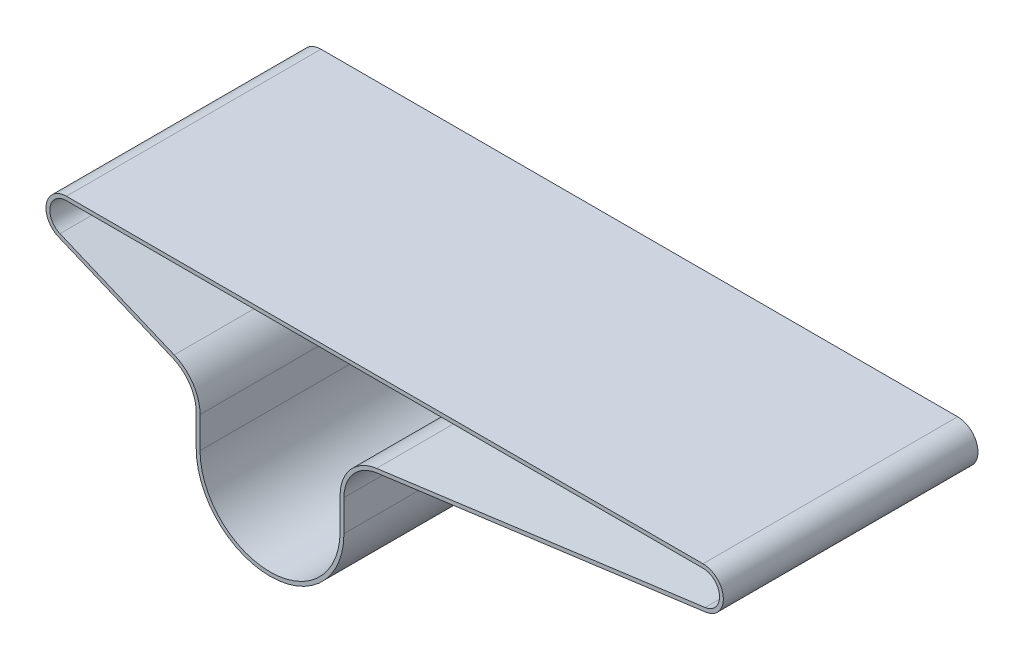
ISO-10303-21;
HEADER;
FILE_DESCRIPTION(('STEP AP214'),'2;1');
FILE_NAME('part.step','',(''),(''),'','','');
FILE_SCHEMA(('AUTOMOTIVE_DESIGN { 1 0 10303 214 1 1 1 1 }'));
ENDSEC;
DATA;
#1=APPLICATION_CONTEXT('core data for automotive mechanical design processes');
#2=APPLICATION_PROTOCOL_DEFINITION('international standard','automotive_design',2000,#1);
#3=PRODUCT_CONTEXT('',#1,'mechanical');
#4=PRODUCT('Part','Part','',(#3));
#5=PRODUCT_RELATED_PRODUCT_CATEGORY('part','',(#4));
#6=PRODUCT_DEFINITION_FORMATION('','',#4);
#7=PRODUCT_DEFINITION_CONTEXT('part definition',#1,'design');
#8=PRODUCT_DEFINITION('design','',#6,#7);
#9=PRODUCT_DEFINITION_SHAPE('','',#8);
#10=(LENGTH_UNIT() NAMED_UNIT(*) SI_UNIT(.MILLI.,.METRE.));
#11=(NAMED_UNIT(*) PLANE_ANGLE_UNIT() SI_UNIT($,.RADIAN.));
#12=(NAMED_UNIT(*) SI_UNIT($,.STERADIAN.) SOLID_ANGLE_UNIT());
#13=UNCERTAINTY_MEASURE_WITH_UNIT(LENGTH_MEASURE(1.E-05),#10,'distance_accuracy_value','');
#14=(GEOMETRIC_REPRESENTATION_CONTEXT(3) GLOBAL_UNCERTAINTY_ASSIGNED_CONTEXT((#13)) GLOBAL_UNIT_ASSIGNED_CONTEXT((#10,
#11,#12)) REPRESENTATION_CONTEXT('',''));
#15=CARTESIAN_POINT('',(0.,0.,0.));
#16=DIRECTION('',(0.,0.,1.));
#17=DIRECTION('',(1.,0.,0.));
#18=AXIS2_PLACEMENT_3D('',#15,#16,#17);
#19=CARTESIAN_POINT('',(0.,0.,50.));
#20=DIRECTION('',(0.,0.,1.));
#21=DIRECTION('',(1.,0.,0.));
#22=AXIS2_PLACEMENT_3D('',#19,#20,#21);
#23=PLANE('',#22);
#24=CARTESIAN_POINT('',(0.,0.,50.));
#25=DIRECTION('',(0.,0.,1.));
#26=DIRECTION('',(1.,0.,0.));
#27=AXIS2_PLACEMENT_3D('',#24,#25,#26);
#28=CIRCLE('',#27,8.);
#29=CARTESIAN_POINT('',(0.,8.,50.));
#30=VERTEX_POINT('',#29);
#31=CARTESIAN_POINT('',(-3.08859936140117,-7.37973942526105,50.));
#32=VERTEX_POINT('',#31);
#33=EDGE_CURVE('E2895',#30,#32,#28,.T.);
#34=ORIENTED_EDGE('',*,*,#33,.T.);
#35=DIRECTION('',(0.922467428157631,-0.386074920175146,0.));
#36=VECTOR('',#35,1.);
#37=CARTESIAN_POINT('',(-3.08859936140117,-7.37973942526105,50.));
#38=LINE('',#37,#36);
#39=CARTESIAN_POINT('',(41.7911238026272,-26.1629885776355,50.));
#40=VERTEX_POINT('',#39);
#41=EDGE_CURVE('E2898',#32,#40,#38,.T.);
#42=ORIENTED_EDGE('',*,*,#41,.T.);
#43=CARTESIAN_POINT('',(36.,-40.,50.));
#44=DIRECTION('',(0.,0.,1.));
#45=DIRECTION('',(1.,0.,0.));
#46=AXIS2_PLACEMENT_3D('',#43,#44,#45);
#47=CIRCLE('',#46,15.);
#48=CARTESIAN_POINT('',(51.,-40.,50.));
#49=VERTEX_POINT('',#48);
#50=EDGE_CURVE('E2900',#40,#49,#47,.F.);
#51=ORIENTED_EDGE('',*,*,#50,.T.);
#52=DIRECTION('',(0.,-1.,0.));
#53=VECTOR('',#52,1.);
#54=CARTESIAN_POINT('',(51.,-40.,50.));
#55=LINE('',#54,#53);
#56=CARTESIAN_POINT('',(51.,-52.274500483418,50.));
#57=VERTEX_POINT('',#56);
#58=EDGE_CURVE('E2902',#49,#57,#55,.T.);
#59=ORIENTED_EDGE('',*,*,#58,.T.);
#60=CARTESIAN_POINT('',(80.,-52.274500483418,50.));
#61=DIRECTION('',(0.,0.,1.));
#62=DIRECTION('',(1.,0.,0.));
#63=AXIS2_PLACEMENT_3D('',#60,#61,#62);
#64=CIRCLE('',#63,29.);
#65=CARTESIAN_POINT('',(109.,-52.274500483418,50.));
#66=VERTEX_POINT('',#65);
#67=EDGE_CURVE('E2904',#57,#66,#64,.T.);
#68=ORIENTED_EDGE('',*,*,#67,.T.);
#69=DIRECTION('',(0.,1.,0.));
#70=VECTOR('',#69,1.);
#71=CARTESIAN_POINT('',(109.,-52.274500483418,50.));
#72=LINE('',#71,#70);
#73=CARTESIAN_POINT('',(109.,-40.,50.));
#74=VERTEX_POINT('',#73);
#75=EDGE_CURVE('E2906',#66,#74,#72,.T.);
#76=ORIENTED_EDGE('',*,*,#75,.T.);
#77=CARTESIAN_POINT('',(124.,-40.,50.));
#78=DIRECTION('',(0.,0.,1.));
#79=DIRECTION('',(1.,0.,0.));
#80=AXIS2_PLACEMENT_3D('',#77,#78,#79);
#81=CIRCLE('',#80,15.);
#82=CARTESIAN_POINT('',(122.017945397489,-25.131528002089,50.));
#83=VERTEX_POINT('',#82);
#84=EDGE_CURVE('E2908',#74,#83,#81,.F.);
#85=ORIENTED_EDGE('',*,*,#84,.T.);
#86=DIRECTION('',(0.9912314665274,0.132136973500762,0.));
#87=VECTOR('',#86,1.);
#88=CARTESIAN_POINT('',(122.017945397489,-25.131528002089,50.));
#89=LINE('',#88,#87);
#90=CARTESIAN_POINT('',(251.057095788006,-7.92985173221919,50.));
#91=VERTEX_POINT('',#90);
#92=EDGE_CURVE('E2910',#83,#91,#89,.T.);
#93=ORIENTED_EDGE('',*,*,#92,.T.);
#94=CARTESIAN_POINT('',(250.,0.,50.));
#95=DIRECTION('',(0.,0.,1.));
#96=DIRECTION('',(1.,0.,0.));
#97=AXIS2_PLACEMENT_3D('',#94,#95,#96);
#98=CIRCLE('',#97,8.00000000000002);
#99=CARTESIAN_POINT('',(250.,8.00000000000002,50.));
#100=VERTEX_POINT('',#99);
#101=EDGE_CURVE('E2912',#91,#100,#98,.T.);
#102=ORIENTED_EDGE('',*,*,#101,.T.);
#103=DIRECTION('',(-1.,0.,0.));
#104=VECTOR('',#103,1.);
#105=CARTESIAN_POINT('',(250.,8.00000000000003,50.));
#106=LINE('',#105,#104);
#107=EDGE_CURVE('E2914',#100,#30,#106,.T.);
#108=ORIENTED_EDGE('',*,*,#107,.T.);
#109=EDGE_LOOP('',(#34,#42,#51,#59,#68,#76,#85,#93,#102,#108));
#110=FACE_BOUND('',#109,.T.);
#111=DIRECTION('',(0.922467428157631,-0.386074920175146,0.));
#112=VECTOR('',#111,1.);
#113=CARTESIAN_POINT('',(-2.50948698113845,-5.9960382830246,50.));
#114=LINE('',#113,#112);
#115=CARTESIAN_POINT('',(-2.50948698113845,-5.9960382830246,50.));
#116=VERTEX_POINT('',#115);
#117=CARTESIAN_POINT('',(42.3702361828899,-24.7792874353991,50.));
#118=VERTEX_POINT('',#117);
#119=EDGE_CURVE('E2841',#116,#118,#114,.T.);
#120=ORIENTED_EDGE('',*,*,#119,.F.);
#121=CARTESIAN_POINT('',(0.,0.,50.));
#122=DIRECTION('',(0.,0.,1.));
#123=DIRECTION('',(1.,0.,0.));
#124=AXIS2_PLACEMENT_3D('',#121,#122,#123);
#125=CIRCLE('',#124,6.5);
#126=CARTESIAN_POINT('',(0.,6.5,50.));
#127=VERTEX_POINT('',#126);
#128=EDGE_CURVE('E2812',#127,#116,#125,.T.);
#129=ORIENTED_EDGE('',*,*,#128,.F.);
#130=DIRECTION('',(-1.,0.,0.));
#131=VECTOR('',#130,1.);
#132=CARTESIAN_POINT('',(250.,6.50000000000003,50.));
#133=LINE('',#132,#131);
#134=CARTESIAN_POINT('',(250.,6.50000000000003,50.));
#135=VERTEX_POINT('',#134);
#136=EDGE_CURVE('E2857',#135,#127,#133,.T.);
#137=ORIENTED_EDGE('',*,*,#136,.F.);
#138=CARTESIAN_POINT('',(250.,0.,50.));
#139=DIRECTION('',(0.,0.,1.));
#140=DIRECTION('',(1.,0.,0.));
#141=AXIS2_PLACEMENT_3D('',#138,#139,#140);
#142=CIRCLE('',#141,6.50000000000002);
#143=CARTESIAN_POINT('',(250.858890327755,-6.44300453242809,50.));
#144=VERTEX_POINT('',#143);
#145=EDGE_CURVE('E2855',#144,#135,#142,.T.);
#146=ORIENTED_EDGE('',*,*,#145,.F.);
#147=DIRECTION('',(0.9912314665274,0.132136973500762,0.));
#148=VECTOR('',#147,1.);
#149=CARTESIAN_POINT('',(121.819739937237,-23.6446808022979,50.));
#150=LINE('',#149,#148);
#151=CARTESIAN_POINT('',(121.819739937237,-23.6446808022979,50.));
#152=VERTEX_POINT('',#151);
#153=EDGE_CURVE('E2853',#152,#144,#150,.T.);
#154=ORIENTED_EDGE('',*,*,#153,.F.);
#155=CARTESIAN_POINT('',(124.,-40.,50.));
#156=DIRECTION('',(0.,0.,1.));
#157=DIRECTION('',(1.,0.,0.));
#158=AXIS2_PLACEMENT_3D('',#155,#156,#157);
#159=CIRCLE('',#158,16.5);
#160=CARTESIAN_POINT('',(107.5,-40.,50.));
#161=VERTEX_POINT('',#160);
#162=EDGE_CURVE('E2851',#161,#152,#159,.F.);
#163=ORIENTED_EDGE('',*,*,#162,.F.);
#164=DIRECTION('',(0.,1.,0.));
#165=VECTOR('',#164,1.);
#166=CARTESIAN_POINT('',(107.5,-52.274500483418,50.));
#167=LINE('',#166,#165);
#168=CARTESIAN_POINT('',(107.5,-52.274500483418,50.));
#169=VERTEX_POINT('',#168);
#170=EDGE_CURVE('E2849',#169,#161,#167,.T.);
#171=ORIENTED_EDGE('',*,*,#170,.F.);
#172=CARTESIAN_POINT('',(80.,-52.274500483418,50.));
#173=DIRECTION('',(0.,0.,1.));
#174=DIRECTION('',(1.,0.,0.));
#175=AXIS2_PLACEMENT_3D('',#172,#173,#174);
#176=CIRCLE('',#175,27.5);
#177=CARTESIAN_POINT('',(52.5,-52.274500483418,50.));
#178=VERTEX_POINT('',#177);
#179=EDGE_CURVE('E2847',#178,#169,#176,.T.);
#180=ORIENTED_EDGE('',*,*,#179,.F.);
#181=DIRECTION('',(0.,-1.,0.));
#182=VECTOR('',#181,1.);
#183=CARTESIAN_POINT('',(52.5,-40.,50.));
#184=LINE('',#183,#182);
#185=CARTESIAN_POINT('',(52.5,-40.,50.));
#186=VERTEX_POINT('',#185);
#187=EDGE_CURVE('E2845',#186,#178,#184,.T.);
#188=ORIENTED_EDGE('',*,*,#187,.F.);
#189=CARTESIAN_POINT('',(36.,-40.,50.));
#190=DIRECTION('',(0.,0.,1.));
#191=DIRECTION('',(1.,0.,0.));
#192=AXIS2_PLACEMENT_3D('',#189,#190,#191);
#193=CIRCLE('',#192,16.5);
#194=EDGE_CURVE('E2843',#118,#186,#193,.F.);
#195=ORIENTED_EDGE('',*,*,#194,.F.);
#196=EDGE_LOOP('',(#120,#129,#137,#146,#154,#163,#171,#180,#188,#195));
#197=FACE_BOUND('',#196,.T.);
#198=ADVANCED_FACE('F2660',(#110,#197),#23,.T.);
#199=CARTESIAN_POINT('',(0.,0.,-50.));
#200=DIRECTION('',(0.,0.,1.));
#201=DIRECTION('',(1.,0.,0.));
#202=AXIS2_PLACEMENT_3D('',#199,#200,#201);
#203=PLANE('',#202);
#204=CARTESIAN_POINT('',(0.,0.,-50.));
#205=DIRECTION('',(0.,0.,1.));
#206=DIRECTION('',(1.,0.,0.));
#207=AXIS2_PLACEMENT_3D('',#204,#205,#206);
#208=CIRCLE('',#207,8.);
#209=CARTESIAN_POINT('',(0.,8.,-50.));
#210=VERTEX_POINT('',#209);
#211=CARTESIAN_POINT('',(-3.08859936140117,-7.37973942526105,-50.));
#212=VERTEX_POINT('',#211);
#213=EDGE_CURVE('E2813',#210,#212,#208,.T.);
#214=ORIENTED_EDGE('',*,*,#213,.F.);
#215=DIRECTION('',(-1.,0.,0.));
#216=VECTOR('',#215,1.);
#217=CARTESIAN_POINT('',(250.,8.00000000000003,-50.));
#218=LINE('',#217,#216);
#219=CARTESIAN_POINT('',(250.,8.00000000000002,-50.));
#220=VERTEX_POINT('',#219);
#221=EDGE_CURVE('E2893',#220,#210,#218,.T.);
#222=ORIENTED_EDGE('',*,*,#221,.F.);
#223=CARTESIAN_POINT('',(250.,0.,-50.));
#224=DIRECTION('',(0.,0.,1.));
#225=DIRECTION('',(1.,0.,0.));
#226=AXIS2_PLACEMENT_3D('',#223,#224,#225);
#227=CIRCLE('',#226,8.00000000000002);
#228=CARTESIAN_POINT('',(251.057095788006,-7.92985173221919,-50.));
#229=VERTEX_POINT('',#228);
#230=EDGE_CURVE('E2891',#229,#220,#227,.T.);
#231=ORIENTED_EDGE('',*,*,#230,.F.);
#232=DIRECTION('',(0.9912314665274,0.132136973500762,0.));
#233=VECTOR('',#232,1.);
#234=CARTESIAN_POINT('',(122.017945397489,-25.131528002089,-50.));
#235=LINE('',#234,#233);
#236=CARTESIAN_POINT('',(122.017945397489,-25.131528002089,-50.));
#237=VERTEX_POINT('',#236);
#238=EDGE_CURVE('E2889',#237,#229,#235,.T.);
#239=ORIENTED_EDGE('',*,*,#238,.F.);
#240=CARTESIAN_POINT('',(124.,-40.,-50.));
#241=DIRECTION('',(0.,0.,1.));
#242=DIRECTION('',(1.,0.,0.));
#243=AXIS2_PLACEMENT_3D('',#240,#241,#242);
#244=CIRCLE('',#243,15.);
#245=CARTESIAN_POINT('',(109.,-40.,-50.));
#246=VERTEX_POINT('',#245);
#247=EDGE_CURVE('E2887',#246,#237,#244,.F.);
#248=ORIENTED_EDGE('',*,*,#247,.F.);
#249=DIRECTION('',(0.,1.,0.));
#250=VECTOR('',#249,1.);
#251=CARTESIAN_POINT('',(109.,-52.274500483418,-50.));
#252=LINE('',#251,#250);
#253=CARTESIAN_POINT('',(109.,-52.274500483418,-50.));
#254=VERTEX_POINT('',#253);
#255=EDGE_CURVE('E2885',#254,#246,#252,.T.);
#256=ORIENTED_EDGE('',*,*,#255,.F.);
#257=CARTESIAN_POINT('',(80.,-52.274500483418,-50.));
#258=DIRECTION('',(0.,0.,1.));
#259=DIRECTION('',(1.,0.,0.));
#260=AXIS2_PLACEMENT_3D('',#257,#258,#259);
#261=CIRCLE('',#260,29.);
#262=CARTESIAN_POINT('',(51.,-52.274500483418,-50.));
#263=VERTEX_POINT('',#262);
#264=EDGE_CURVE('E2883',#263,#254,#261,.T.);
#265=ORIENTED_EDGE('',*,*,#264,.F.);
#266=DIRECTION('',(0.,-1.,0.));
#267=VECTOR('',#266,1.);
#268=CARTESIAN_POINT('',(51.,-40.,-50.));
#269=LINE('',#268,#267);
#270=CARTESIAN_POINT('',(51.,-40.,-50.));
#271=VERTEX_POINT('',#270);
#272=EDGE_CURVE('E2881',#271,#263,#269,.T.);
#273=ORIENTED_EDGE('',*,*,#272,.F.);
#274=CARTESIAN_POINT('',(36.,-40.,-50.));
#275=DIRECTION('',(0.,0.,1.));
#276=DIRECTION('',(1.,0.,0.));
#277=AXIS2_PLACEMENT_3D('',#274,#275,#276);
#278=CIRCLE('',#277,15.);
#279=CARTESIAN_POINT('',(41.7911238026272,-26.1629885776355,-50.));
#280=VERTEX_POINT('',#279);
#281=EDGE_CURVE('E2879',#280,#271,#278,.F.);
#282=ORIENTED_EDGE('',*,*,#281,.F.);
#283=DIRECTION('',(0.922467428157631,-0.386074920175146,0.));
#284=VECTOR('',#283,1.);
#285=CARTESIAN_POINT('',(-3.08859936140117,-7.37973942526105,-50.));
#286=LINE('',#285,#284);
#287=EDGE_CURVE('E2877',#212,#280,#286,.T.);
#288=ORIENTED_EDGE('',*,*,#287,.F.);
#289=EDGE_LOOP('',(#214,#222,#231,#239,#248,#256,#265,#273,#282,#288));
#290=FACE_BOUND('',#289,.T.);
#291=CARTESIAN_POINT('',(0.,0.,-50.));
#292=DIRECTION('',(0.,0.,1.));
#293=DIRECTION('',(1.,0.,0.));
#294=AXIS2_PLACEMENT_3D('',#291,#292,#293);
#295=CIRCLE('',#294,6.5);
#296=CARTESIAN_POINT('',(0.,6.5,-50.));
#297=VERTEX_POINT('',#296);
#298=CARTESIAN_POINT('',(-2.50948698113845,-5.9960382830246,-50.));
#299=VERTEX_POINT('',#298);
#300=EDGE_CURVE('E2683',#297,#299,#295,.T.);
#301=ORIENTED_EDGE('',*,*,#300,.T.);
#302=DIRECTION('',(0.922467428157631,-0.386074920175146,0.));
#303=VECTOR('',#302,1.);
#304=CARTESIAN_POINT('',(-2.50948698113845,-5.9960382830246,-50.));
#305=LINE('',#304,#303);
#306=CARTESIAN_POINT('',(42.3702361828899,-24.7792874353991,-50.));
#307=VERTEX_POINT('',#306);
#308=EDGE_CURVE('E2799',#299,#307,#305,.T.);
#309=ORIENTED_EDGE('',*,*,#308,.T.);
#310=CARTESIAN_POINT('',(36.,-40.,-50.));
#311=DIRECTION('',(0.,0.,1.));
#312=DIRECTION('',(1.,0.,0.));
#313=AXIS2_PLACEMENT_3D('',#310,#311,#312);
#314=CIRCLE('',#313,16.5);
#315=CARTESIAN_POINT('',(52.5,-40.,-50.));
#316=VERTEX_POINT('',#315);
#317=EDGE_CURVE('E2808',#307,#316,#314,.F.);
#318=ORIENTED_EDGE('',*,*,#317,.T.);
#319=DIRECTION('',(0.,-1.,0.));
#320=VECTOR('',#319,1.);
#321=CARTESIAN_POINT('',(52.5,-40.,-50.));
#322=LINE('',#321,#320);
#323=CARTESIAN_POINT('',(52.5,-52.274500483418,-50.));
#324=VERTEX_POINT('',#323);
#325=EDGE_CURVE('E2822',#316,#324,#322,.T.);
#326=ORIENTED_EDGE('',*,*,#325,.T.);
#327=CARTESIAN_POINT('',(80.,-52.274500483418,-50.));
#328=DIRECTION('',(0.,0.,1.));
#329=DIRECTION('',(1.,0.,0.));
#330=AXIS2_PLACEMENT_3D('',#327,#328,#329);
#331=CIRCLE('',#330,27.5);
#332=CARTESIAN_POINT('',(107.5,-52.274500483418,-50.));
#333=VERTEX_POINT('',#332);
#334=EDGE_CURVE('E2825',#324,#333,#331,.T.);
#335=ORIENTED_EDGE('',*,*,#334,.T.);
#336=DIRECTION('',(0.,1.,0.));
#337=VECTOR('',#336,1.);
#338=CARTESIAN_POINT('',(107.5,-52.274500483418,-50.));
#339=LINE('',#338,#337);
#340=CARTESIAN_POINT('',(107.5,-40.,-50.));
#341=VERTEX_POINT('',#340);
#342=EDGE_CURVE('E2828',#333,#341,#339,.T.);
#343=ORIENTED_EDGE('',*,*,#342,.T.);
#344=CARTESIAN_POINT('',(124.,-40.,-50.));
#345=DIRECTION('',(0.,0.,1.));
#346=DIRECTION('',(1.,0.,0.));
#347=AXIS2_PLACEMENT_3D('',#344,#345,#346);
#348=CIRCLE('',#347,16.5);
#349=CARTESIAN_POINT('',(121.819739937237,-23.6446808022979,-50.));
#350=VERTEX_POINT('',#349);
#351=EDGE_CURVE('E2831',#341,#350,#348,.F.);
#352=ORIENTED_EDGE('',*,*,#351,.T.);
#353=DIRECTION('',(0.9912314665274,0.132136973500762,0.));
#354=VECTOR('',#353,1.);
#355=CARTESIAN_POINT('',(121.819739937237,-23.6446808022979,-50.));
#356=LINE('',#355,#354);
#357=CARTESIAN_POINT('',(250.858890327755,-6.44300453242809,-50.));
#358=VERTEX_POINT('',#357);
#359=EDGE_CURVE('E2834',#350,#358,#356,.T.);
#360=ORIENTED_EDGE('',*,*,#359,.T.);
#361=CARTESIAN_POINT('',(250.,0.,-50.));
#362=DIRECTION('',(0.,0.,1.));
#363=DIRECTION('',(1.,0.,0.));
#364=AXIS2_PLACEMENT_3D('',#361,#362,#363);
#365=CIRCLE('',#364,6.50000000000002);
#366=CARTESIAN_POINT('',(250.,6.50000000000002,-50.));
#367=VERTEX_POINT('',#366);
#368=EDGE_CURVE('E2837',#358,#367,#365,.T.);
#369=ORIENTED_EDGE('',*,*,#368,.T.);
#370=DIRECTION('',(-1.,0.,0.));
#371=VECTOR('',#370,1.);
#372=CARTESIAN_POINT('',(250.,6.50000000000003,-50.));
#373=LINE('',#372,#371);
#374=EDGE_CURVE('E2818',#367,#297,#373,.T.);
#375=ORIENTED_EDGE('',*,*,#374,.T.);
#376=EDGE_LOOP('',(#301,#309,#318,#326,#335,#343,#352,#360,#369,#375));
#377=FACE_BOUND('',#376,.T.);
#378=ADVANCED_FACE('F2816',(#290,#377),#203,.F.);
#379=CARTESIAN_POINT('',(0.,0.,50.));
#380=DIRECTION('',(0.,0.,-1.));
#381=DIRECTION('',(-1.,0.,0.));
#382=AXIS2_PLACEMENT_3D('',#379,#380,#381);
#383=CYLINDRICAL_SURFACE('',#382,8.);
#384=ORIENTED_EDGE('',*,*,#213,.T.);
#385=DIRECTION('',(0.,0.,-1.));
#386=VECTOR('',#385,1.);
#387=CARTESIAN_POINT('',(-3.08859936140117,-7.37973942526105,50.));
#388=LINE('',#387,#386);
#389=EDGE_CURVE('E12',#32,#212,#388,.T.);
#390=ORIENTED_EDGE('',*,*,#389,.F.);
#391=ORIENTED_EDGE('',*,*,#33,.F.);
#392=DIRECTION('',(0.,0.,-1.));
#393=VECTOR('',#392,1.);
#394=CARTESIAN_POINT('',(0.,8.,50.));
#395=LINE('',#394,#393);
#396=EDGE_CURVE('E2916',#30,#210,#395,.T.);
#397=ORIENTED_EDGE('',*,*,#396,.T.);
#398=EDGE_LOOP('',(#384,#390,#391,#397));
#399=FACE_BOUND('',#398,.T.);
#400=ADVANCED_FACE('F2662',(#399),#383,.T.);
#401=CARTESIAN_POINT('',(-3.08859936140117,-7.37973942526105,50.));
#402=DIRECTION('',(0.386074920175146,0.922467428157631,0.));
#403=DIRECTION('',(-0.922467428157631,0.386074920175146,0.));
#404=AXIS2_PLACEMENT_3D('',#401,#402,#403);
#405=PLANE('',#404);
#406=ORIENTED_EDGE('',*,*,#287,.T.);
#407=DIRECTION('',(0.,0.,-1.));
#408=VECTOR('',#407,1.);
#409=CARTESIAN_POINT('',(41.7911238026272,-26.1629885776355,50.));
#410=LINE('',#409,#408);
#411=EDGE_CURVE('E2668',#40,#280,#410,.T.);
#412=ORIENTED_EDGE('',*,*,#411,.F.);
#413=ORIENTED_EDGE('',*,*,#41,.F.);
#414=ORIENTED_EDGE('',*,*,#389,.T.);
#415=EDGE_LOOP('',(#406,#412,#413,#414));
#416=FACE_BOUND('',#415,.T.);
#417=ADVANCED_FACE('F2966',(#416),#405,.F.);
#418=CARTESIAN_POINT('',(36.,-40.,50.));
#419=DIRECTION('',(0.,0.,-1.));
#420=DIRECTION('',(-1.,0.,0.));
#421=AXIS2_PLACEMENT_3D('',#418,#419,#420);
#422=CYLINDRICAL_SURFACE('',#421,15.);
#423=ORIENTED_EDGE('',*,*,#281,.T.);
#424=DIRECTION('',(0.,0.,-1.));
#425=VECTOR('',#424,1.);
#426=CARTESIAN_POINT('',(51.,-40.,50.));
#427=LINE('',#426,#425);
#428=EDGE_CURVE('E2937',#49,#271,#427,.T.);
#429=ORIENTED_EDGE('',*,*,#428,.F.);
#430=ORIENTED_EDGE('',*,*,#50,.F.);
#431=ORIENTED_EDGE('',*,*,#411,.T.);
#432=EDGE_LOOP('',(#423,#429,#430,#431));
#433=FACE_BOUND('',#432,.T.);
#434=ADVANCED_FACE('F2944',(#433),#422,.F.);
#435=CARTESIAN_POINT('',(51.,-40.,50.));
#436=DIRECTION('',(1.,0.,0.));
#437=DIRECTION('',(0.,0.,-1.));
#438=AXIS2_PLACEMENT_3D('',#435,#436,#437);
#439=PLANE('',#438);
#440=ORIENTED_EDGE('',*,*,#272,.T.);
#441=DIRECTION('',(0.,0.,-1.));
#442=VECTOR('',#441,1.);
#443=CARTESIAN_POINT('',(51.,-52.274500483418,50.));
#444=LINE('',#443,#442);
#445=EDGE_CURVE('E2934',#57,#263,#444,.T.);
#446=ORIENTED_EDGE('',*,*,#445,.F.);
#447=ORIENTED_EDGE('',*,*,#58,.F.);
#448=ORIENTED_EDGE('',*,*,#428,.T.);
#449=EDGE_LOOP('',(#440,#446,#447,#448));
#450=FACE_BOUND('',#449,.T.);
#451=ADVANCED_FACE('F2954',(#450),#439,.F.);
#452=CARTESIAN_POINT('',(80.,-52.274500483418,50.));
#453=DIRECTION('',(0.,0.,-1.));
#454=DIRECTION('',(-1.,0.,0.));
#455=AXIS2_PLACEMENT_3D('',#452,#453,#454);
#456=CYLINDRICAL_SURFACE('',#455,29.);
#457=ORIENTED_EDGE('',*,*,#264,.T.);
#458=DIRECTION('',(0.,0.,-1.));
#459=VECTOR('',#458,1.);
#460=CARTESIAN_POINT('',(109.,-52.274500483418,50.));
#461=LINE('',#460,#459);
#462=EDGE_CURVE('E2931',#66,#254,#461,.T.);
#463=ORIENTED_EDGE('',*,*,#462,.F.);
#464=ORIENTED_EDGE('',*,*,#67,.F.);
#465=ORIENTED_EDGE('',*,*,#445,.T.);
#466=EDGE_LOOP('',(#457,#463,#464,#465));
#467=FACE_BOUND('',#466,.T.);
#468=ADVANCED_FACE('F2958',(#467),#456,.T.);
#469=CARTESIAN_POINT('',(109.,-52.274500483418,50.));
#470=DIRECTION('',(-1.,0.,0.));
#471=DIRECTION('',(0.,0.,1.));
#472=AXIS2_PLACEMENT_3D('',#469,#470,#471);
#473=PLANE('',#472);
#474=ORIENTED_EDGE('',*,*,#255,.T.);
#475=DIRECTION('',(0.,0.,-1.));
#476=VECTOR('',#475,1.);
#477=CARTESIAN_POINT('',(109.,-40.,50.));
#478=LINE('',#477,#476);
#479=EDGE_CURVE('E2928',#74,#246,#478,.T.);
#480=ORIENTED_EDGE('',*,*,#479,.F.);
#481=ORIENTED_EDGE('',*,*,#75,.F.);
#482=ORIENTED_EDGE('',*,*,#462,.T.);
#483=EDGE_LOOP('',(#474,#480,#481,#482));
#484=FACE_BOUND('',#483,.T.);
#485=ADVANCED_FACE('F2989',(#484),#473,.F.);
#486=CARTESIAN_POINT('',(124.,-40.,50.));
#487=DIRECTION('',(0.,0.,-1.));
#488=DIRECTION('',(-1.,0.,0.));
#489=AXIS2_PLACEMENT_3D('',#486,#487,#488);
#490=CYLINDRICAL_SURFACE('',#489,15.);
#491=ORIENTED_EDGE('',*,*,#247,.T.);
#492=DIRECTION('',(0.,0.,-1.));
#493=VECTOR('',#492,1.);
#494=CARTESIAN_POINT('',(122.017945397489,-25.131528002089,50.));
#495=LINE('',#494,#493);
#496=EDGE_CURVE('E2925',#83,#237,#495,.T.);
#497=ORIENTED_EDGE('',*,*,#496,.F.);
#498=ORIENTED_EDGE('',*,*,#84,.F.);
#499=ORIENTED_EDGE('',*,*,#479,.T.);
#500=EDGE_LOOP('',(#491,#497,#498,#499));
#501=FACE_BOUND('',#500,.T.);
#502=ADVANCED_FACE('F2986',(#501),#490,.F.);
#503=CARTESIAN_POINT('',(122.017945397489,-25.131528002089,50.));
#504=DIRECTION('',(-0.132136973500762,0.991231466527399,0.));
#505=DIRECTION('',(-0.9912314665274,-0.132136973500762,0.));
#506=AXIS2_PLACEMENT_3D('',#503,#504,#505);
#507=PLANE('',#506);
#508=ORIENTED_EDGE('',*,*,#238,.T.);
#509=DIRECTION('',(0.,0.,-1.));
#510=VECTOR('',#509,1.);
#511=CARTESIAN_POINT('',(251.057095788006,-7.92985173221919,50.));
#512=LINE('',#511,#510);
#513=EDGE_CURVE('E2922',#91,#229,#512,.T.);
#514=ORIENTED_EDGE('',*,*,#513,.F.);
#515=ORIENTED_EDGE('',*,*,#92,.F.);
#516=ORIENTED_EDGE('',*,*,#496,.T.);
#517=EDGE_LOOP('',(#508,#514,#515,#516));
#518=FACE_BOUND('',#517,.T.);
#519=ADVANCED_FACE('F2982',(#518),#507,.F.);
#520=CARTESIAN_POINT('',(250.,0.,50.));
#521=DIRECTION('',(0.,0.,-1.));
#522=DIRECTION('',(-1.,0.,0.));
#523=AXIS2_PLACEMENT_3D('',#520,#521,#522);
#524=CYLINDRICAL_SURFACE('',#523,8.00000000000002);
#525=ORIENTED_EDGE('',*,*,#230,.T.);
#526=DIRECTION('',(0.,0.,-1.));
#527=VECTOR('',#526,1.);
#528=CARTESIAN_POINT('',(250.,8.00000000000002,50.));
#529=LINE('',#528,#527);
#530=EDGE_CURVE('E2919',#100,#220,#529,.T.);
#531=ORIENTED_EDGE('',*,*,#530,.F.);
#532=ORIENTED_EDGE('',*,*,#101,.F.);
#533=ORIENTED_EDGE('',*,*,#513,.T.);
#534=EDGE_LOOP('',(#525,#531,#532,#533));
#535=FACE_BOUND('',#534,.T.);
#536=ADVANCED_FACE('F2978',(#535),#524,.T.);
#537=CARTESIAN_POINT('',(250.,8.00000000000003,50.));
#538=DIRECTION('',(0.,-1.,0.));
#539=DIRECTION('',(1.,0.,0.));
#540=AXIS2_PLACEMENT_3D('',#537,#538,#539);
#541=PLANE('',#540);
#542=ORIENTED_EDGE('',*,*,#221,.T.);
#543=ORIENTED_EDGE('',*,*,#396,.F.);
#544=ORIENTED_EDGE('',*,*,#107,.F.);
#545=ORIENTED_EDGE('',*,*,#530,.T.);
#546=EDGE_LOOP('',(#542,#543,#544,#545));
#547=FACE_BOUND('',#546,.T.);
#548=ADVANCED_FACE('F2973',(#547),#541,.F.);
#549=CARTESIAN_POINT('',(0.,0.,50.));
#550=DIRECTION('',(0.,0.,-1.));
#551=DIRECTION('',(-1.,0.,0.));
#552=AXIS2_PLACEMENT_3D('',#549,#550,#551);
#553=CYLINDRICAL_SURFACE('',#552,6.5);
#554=ORIENTED_EDGE('',*,*,#300,.F.);
#555=DIRECTION('',(0.,0.,-1.));
#556=VECTOR('',#555,1.);
#557=CARTESIAN_POINT('',(0.,6.5,50.));
#558=LINE('',#557,#556);
#559=EDGE_CURVE('E2859',#127,#297,#558,.T.);
#560=ORIENTED_EDGE('',*,*,#559,.F.);
#561=ORIENTED_EDGE('',*,*,#128,.T.);
#562=DIRECTION('',(0.,0.,-1.));
#563=VECTOR('',#562,1.);
#564=CARTESIAN_POINT('',(-2.50948698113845,-5.9960382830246,50.));
#565=LINE('',#564,#563);
#566=EDGE_CURVE('E2801',#116,#299,#565,.T.);
#567=ORIENTED_EDGE('',*,*,#566,.T.);
#568=EDGE_LOOP('',(#554,#560,#561,#567));
#569=FACE_BOUND('',#568,.T.);
#570=ADVANCED_FACE('F2810',(#569),#553,.F.);
#571=CARTESIAN_POINT('',(-2.50948698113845,-5.9960382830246,50.));
#572=DIRECTION('',(0.386074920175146,0.922467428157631,0.));
#573=DIRECTION('',(-0.922467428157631,0.386074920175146,0.));
#574=AXIS2_PLACEMENT_3D('',#571,#572,#573);
#575=PLANE('',#574);
#576=ORIENTED_EDGE('',*,*,#308,.F.);
#577=ORIENTED_EDGE('',*,*,#566,.F.);
#578=ORIENTED_EDGE('',*,*,#119,.T.);
#579=DIRECTION('',(0.,0.,-1.));
#580=VECTOR('',#579,1.);
#581=CARTESIAN_POINT('',(42.3702361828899,-24.7792874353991,50.));
#582=LINE('',#581,#580);
#583=EDGE_CURVE('E2804',#118,#307,#582,.T.);
#584=ORIENTED_EDGE('',*,*,#583,.T.);
#585=EDGE_LOOP('',(#576,#577,#578,#584));
#586=FACE_BOUND('',#585,.T.);
#587=ADVANCED_FACE('F2800',(#586),#575,.T.);
#588=CARTESIAN_POINT('',(36.,-40.,50.));
#589=DIRECTION('',(0.,0.,-1.));
#590=DIRECTION('',(-1.,0.,0.));
#591=AXIS2_PLACEMENT_3D('',#588,#589,#590);
#592=CYLINDRICAL_SURFACE('',#591,16.5);
#593=ORIENTED_EDGE('',*,*,#317,.F.);
#594=ORIENTED_EDGE('',*,*,#583,.F.);
#595=ORIENTED_EDGE('',*,*,#194,.T.);
#596=DIRECTION('',(0.,0.,-1.));
#597=VECTOR('',#596,1.);
#598=CARTESIAN_POINT('',(52.5,-40.,50.));
#599=LINE('',#598,#597);
#600=EDGE_CURVE('E2872',#186,#316,#599,.T.);
#601=ORIENTED_EDGE('',*,*,#600,.T.);
#602=EDGE_LOOP('',(#593,#594,#595,#601));
#603=FACE_BOUND('',#602,.T.);
#604=ADVANCED_FACE('F3034',(#603),#592,.T.);
#605=CARTESIAN_POINT('',(52.5,-40.,50.));
#606=DIRECTION('',(1.,0.,0.));
#607=DIRECTION('',(0.,0.,-1.));
#608=AXIS2_PLACEMENT_3D('',#605,#606,#607);
#609=PLANE('',#608);
#610=ORIENTED_EDGE('',*,*,#325,.F.);
#611=ORIENTED_EDGE('',*,*,#600,.F.);
#612=ORIENTED_EDGE('',*,*,#187,.T.);
#613=DIRECTION('',(0.,0.,-1.));
#614=VECTOR('',#613,1.);
#615=CARTESIAN_POINT('',(52.5,-52.274500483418,50.));
#616=LINE('',#615,#614);
#617=EDGE_CURVE('E2870',#178,#324,#616,.T.);
#618=ORIENTED_EDGE('',*,*,#617,.T.);
#619=EDGE_LOOP('',(#610,#611,#612,#618));
#620=FACE_BOUND('',#619,.T.);
#621=ADVANCED_FACE('F3041',(#620),#609,.T.);
#622=CARTESIAN_POINT('',(80.,-52.274500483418,50.));
#623=DIRECTION('',(0.,0.,-1.));
#624=DIRECTION('',(-1.,0.,0.));
#625=AXIS2_PLACEMENT_3D('',#622,#623,#624);
#626=CYLINDRICAL_SURFACE('',#625,27.5);
#627=ORIENTED_EDGE('',*,*,#334,.F.);
#628=ORIENTED_EDGE('',*,*,#617,.F.);
#629=ORIENTED_EDGE('',*,*,#179,.T.);
#630=DIRECTION('',(0.,0.,-1.));
#631=VECTOR('',#630,1.);
#632=CARTESIAN_POINT('',(107.5,-52.274500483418,50.));
#633=LINE('',#632,#631);
#634=EDGE_CURVE('E2868',#169,#333,#633,.T.);
#635=ORIENTED_EDGE('',*,*,#634,.T.);
#636=EDGE_LOOP('',(#627,#628,#629,#635));
#637=FACE_BOUND('',#636,.T.);
#638=ADVANCED_FACE('F3049',(#637),#626,.F.);
#639=CARTESIAN_POINT('',(107.5,-52.274500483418,50.));
#640=DIRECTION('',(-1.,0.,0.));
#641=DIRECTION('',(0.,0.,1.));
#642=AXIS2_PLACEMENT_3D('',#639,#640,#641);
#643=PLANE('',#642);
#644=ORIENTED_EDGE('',*,*,#342,.F.);
#645=ORIENTED_EDGE('',*,*,#634,.F.);
#646=ORIENTED_EDGE('',*,*,#170,.T.);
#647=DIRECTION('',(0.,0.,-1.));
#648=VECTOR('',#647,1.);
#649=CARTESIAN_POINT('',(107.5,-40.,50.));
#650=LINE('',#649,#648);
#651=EDGE_CURVE('E2866',#161,#341,#650,.T.);
#652=ORIENTED_EDGE('',*,*,#651,.T.);
#653=EDGE_LOOP('',(#644,#645,#646,#652));
#654=FACE_BOUND('',#653,.T.);
#655=ADVANCED_FACE('F3057',(#654),#643,.T.);
#656=CARTESIAN_POINT('',(124.,-40.,50.));
#657=DIRECTION('',(0.,0.,-1.));
#658=DIRECTION('',(-1.,0.,0.));
#659=AXIS2_PLACEMENT_3D('',#656,#657,#658);
#660=CYLINDRICAL_SURFACE('',#659,16.5);
#661=ORIENTED_EDGE('',*,*,#351,.F.);
#662=ORIENTED_EDGE('',*,*,#651,.F.);
#663=ORIENTED_EDGE('',*,*,#162,.T.);
#664=DIRECTION('',(0.,0.,-1.));
#665=VECTOR('',#664,1.);
#666=CARTESIAN_POINT('',(121.819739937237,-23.6446808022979,50.));
#667=LINE('',#666,#665);
#668=EDGE_CURVE('E2864',#152,#350,#667,.T.);
#669=ORIENTED_EDGE('',*,*,#668,.T.);
#670=EDGE_LOOP('',(#661,#662,#663,#669));
#671=FACE_BOUND('',#670,.T.);
#672=ADVANCED_FACE('F3065',(#671),#660,.T.);
#673=CARTESIAN_POINT('',(121.819739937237,-23.6446808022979,50.));
#674=DIRECTION('',(-0.132136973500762,0.991231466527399,0.));
#675=DIRECTION('',(-0.9912314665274,-0.132136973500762,0.));
#676=AXIS2_PLACEMENT_3D('',#673,#674,#675);
#677=PLANE('',#676);
#678=ORIENTED_EDGE('',*,*,#359,.F.);
#679=ORIENTED_EDGE('',*,*,#668,.F.);
#680=ORIENTED_EDGE('',*,*,#153,.T.);
#681=DIRECTION('',(0.,0.,-1.));
#682=VECTOR('',#681,1.);
#683=CARTESIAN_POINT('',(250.858890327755,-6.44300453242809,50.));
#684=LINE('',#683,#682);
#685=EDGE_CURVE('E2862',#144,#358,#684,.T.);
#686=ORIENTED_EDGE('',*,*,#685,.T.);
#687=EDGE_LOOP('',(#678,#679,#680,#686));
#688=FACE_BOUND('',#687,.T.);
#689=ADVANCED_FACE('F3073',(#688),#677,.T.);
#690=CARTESIAN_POINT('',(250.,0.,50.));
#691=DIRECTION('',(0.,0.,-1.));
#692=DIRECTION('',(-1.,0.,0.));
#693=AXIS2_PLACEMENT_3D('',#690,#691,#692);
#694=CYLINDRICAL_SURFACE('',#693,6.50000000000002);
#695=ORIENTED_EDGE('',*,*,#368,.F.);
#696=ORIENTED_EDGE('',*,*,#685,.F.);
#697=ORIENTED_EDGE('',*,*,#145,.T.);
#698=DIRECTION('',(0.,0.,-1.));
#699=VECTOR('',#698,1.);
#700=CARTESIAN_POINT('',(250.,6.50000000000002,50.));
#701=LINE('',#700,#699);
#702=EDGE_CURVE('E2675',#135,#367,#701,.T.);
#703=ORIENTED_EDGE('',*,*,#702,.T.);
#704=EDGE_LOOP('',(#695,#696,#697,#703));
#705=FACE_BOUND('',#704,.T.);
#706=ADVANCED_FACE('F3081',(#705),#694,.F.);
#707=CARTESIAN_POINT('',(250.,6.50000000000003,50.));
#708=DIRECTION('',(0.,-1.,0.));
#709=DIRECTION('',(1.,0.,0.));
#710=AXIS2_PLACEMENT_3D('',#707,#708,#709);
#711=PLANE('',#710);
#712=ORIENTED_EDGE('',*,*,#374,.F.);
#713=ORIENTED_EDGE('',*,*,#702,.F.);
#714=ORIENTED_EDGE('',*,*,#136,.T.);
#715=ORIENTED_EDGE('',*,*,#559,.T.);
#716=EDGE_LOOP('',(#712,#713,#714,#715));
#717=FACE_BOUND('',#716,.T.);
#718=ADVANCED_FACE('F3089',(#717),#711,.T.);
#719=CLOSED_SHELL('',(#198,#378,#400,#417,#434,#451,#468,#485,#502,#519,#536,#548,#570,#587,
#604,#621,#638,#655,#672,#689,#706,#718));
#720=MANIFOLD_SOLID_BREP('B2',#719);
#721=ADVANCED_BREP_SHAPE_REPRESENTATION('',(#18,#720),#14);
#722=SHAPE_DEFINITION_REPRESENTATION(#9,#721);
ENDSEC;
END-ISO-10303-21;
